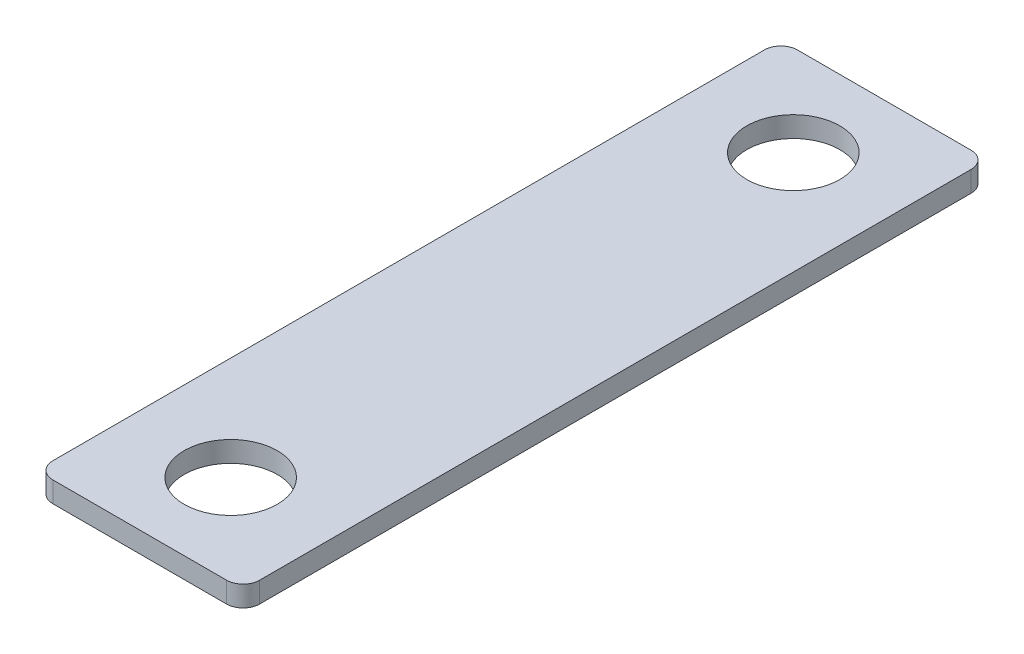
from build123d import *

# Parameters (mm, degrees)
SKETCH1_W           = 31.75
SKETCH1_H           = 114.3
SKETCH1_R           = 7.14375
BOSS_EXTRUDE1_DEPTH = 3.175
FILLET1_R           = 2.54


with BuildPart() as part:
    # Sketch1 → Boss-Extrude1 (new body)
    with BuildSketch(Plane(origin=(0, 0, 0), x_dir=(1, 0, 0), z_dir=(0, 1, 0))):
        Rectangle(SKETCH1_W, SKETCH1_H)
        with Locations(Location((0, 43.18, 0), (0, 0, 270))):
            Circle(SKETCH1_R, mode=Mode.SUBTRACT)
        with Locations(Location((0, -43.18, 0), (0, 0, 270))):
            Circle(SKETCH1_R, mode=Mode.SUBTRACT)
    extrude(amount=BOSS_EXTRUDE1_DEPTH)

    # Fillet1
    fillet1_edges = [part.edges().sort_by_distance(p)[0] for p in [
        (-15.875, 1.5875, -57.15),
        (15.875, 1.5875, -57.15),
        (15.875, 1.5875, 57.15),
        (-15.875, 1.5875, 57.15),
    ]]
    fillet(fillet1_edges, radius=FILLET1_R)


solid = part.part
